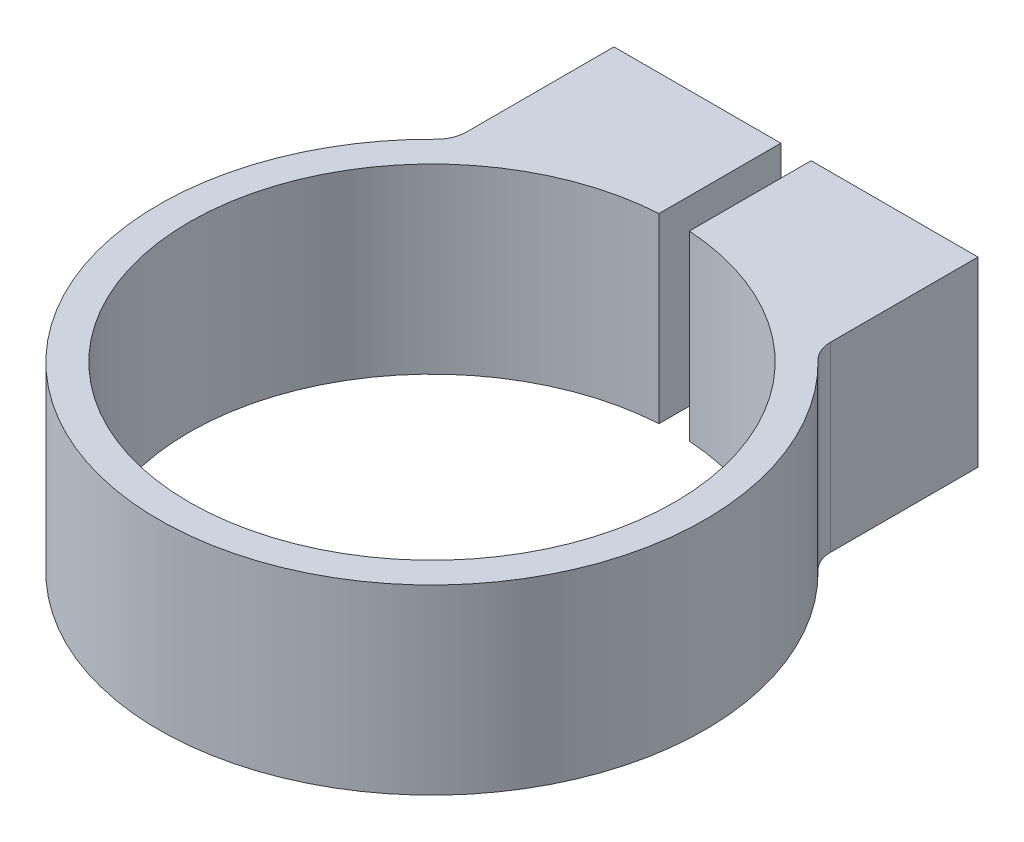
ISO-10303-21;
HEADER;
FILE_DESCRIPTION(('STEP AP214'),'2;1');
FILE_NAME('part.step','',(''),(''),'','','');
FILE_SCHEMA(('AUTOMOTIVE_DESIGN { 1 0 10303 214 1 1 1 1 }'));
ENDSEC;
DATA;
#1=APPLICATION_CONTEXT('core data for automotive mechanical design processes');
#2=APPLICATION_PROTOCOL_DEFINITION('international standard','automotive_design',2000,#1);
#3=PRODUCT_CONTEXT('',#1,'mechanical');
#4=PRODUCT('Part','Part','',(#3));
#5=PRODUCT_RELATED_PRODUCT_CATEGORY('part','',(#4));
#6=PRODUCT_DEFINITION_FORMATION('','',#4);
#7=PRODUCT_DEFINITION_CONTEXT('part definition',#1,'design');
#8=PRODUCT_DEFINITION('design','',#6,#7);
#9=PRODUCT_DEFINITION_SHAPE('','',#8);
#10=(LENGTH_UNIT() NAMED_UNIT(*) SI_UNIT(.MILLI.,.METRE.));
#11=(NAMED_UNIT(*) PLANE_ANGLE_UNIT() SI_UNIT($,.RADIAN.));
#12=(NAMED_UNIT(*) SI_UNIT($,.STERADIAN.) SOLID_ANGLE_UNIT());
#13=UNCERTAINTY_MEASURE_WITH_UNIT(LENGTH_MEASURE(1.E-05),#10,'distance_accuracy_value','');
#14=(GEOMETRIC_REPRESENTATION_CONTEXT(3) GLOBAL_UNCERTAINTY_ASSIGNED_CONTEXT((#13)) GLOBAL_UNIT_ASSIGNED_CONTEXT((#10,
#11,#12)) REPRESENTATION_CONTEXT('',''));
#15=CARTESIAN_POINT('',(0.,0.,0.));
#16=DIRECTION('',(0.,0.,1.));
#17=DIRECTION('',(1.,0.,0.));
#18=AXIS2_PLACEMENT_3D('',#15,#16,#17);
#19=CARTESIAN_POINT('',(-38.1,-38.1,-76.2));
#20=DIRECTION('',(0.,0.,-1.));
#21=DIRECTION('',(-1.,0.,0.));
#22=AXIS2_PLACEMENT_3D('',#19,#20,#21);
#23=PLANE('',#22);
#24=DIRECTION('',(0.,1.,0.));
#25=VECTOR('',#24,1.);
#26=CARTESIAN_POINT('',(-3.175,-38.1,-76.2));
#27=LINE('',#26,#25);
#28=CARTESIAN_POINT('',(-3.175,-38.1,-76.2));
#29=VERTEX_POINT('',#28);
#30=CARTESIAN_POINT('',(-3.175,0.,-76.2));
#31=VERTEX_POINT('',#30);
#32=EDGE_CURVE('E108',#29,#31,#27,.T.);
#33=ORIENTED_EDGE('',*,*,#32,.F.);
#34=DIRECTION('',(-1.,0.,0.));
#35=VECTOR('',#34,1.);
#36=CARTESIAN_POINT('',(-38.1,-38.1,-76.2));
#37=LINE('',#36,#35);
#38=CARTESIAN_POINT('',(-38.1,-38.1,-76.2));
#39=VERTEX_POINT('',#38);
#40=EDGE_CURVE('E147',#29,#39,#37,.T.);
#41=ORIENTED_EDGE('',*,*,#40,.T.);
#42=DIRECTION('',(0.,1.,0.));
#43=VECTOR('',#42,1.);
#44=CARTESIAN_POINT('',(-38.1,-38.1,-76.2));
#45=LINE('',#44,#43);
#46=CARTESIAN_POINT('',(-38.1,0.,-76.2));
#47=VERTEX_POINT('',#46);
#48=EDGE_CURVE('E129',#39,#47,#45,.T.);
#49=ORIENTED_EDGE('',*,*,#48,.T.);
#50=DIRECTION('',(-1.,0.,0.));
#51=VECTOR('',#50,1.);
#52=CARTESIAN_POINT('',(-38.1,0.,-76.2));
#53=LINE('',#52,#51);
#54=EDGE_CURVE('E122',#31,#47,#53,.T.);
#55=ORIENTED_EDGE('',*,*,#54,.F.);
#56=EDGE_LOOP('',(#33,#41,#49,#55));
#57=FACE_BOUND('',#56,.T.);
#58=ADVANCED_FACE('F34',(#57),#23,.T.);
#59=CARTESIAN_POINT('',(-38.1,-38.1,-76.2));
#60=DIRECTION('',(-1.,0.,0.));
#61=DIRECTION('',(0.,0.,1.));
#62=AXIS2_PLACEMENT_3D('',#59,#60,#61);
#63=PLANE('',#62);
#64=DIRECTION('',(0.,0.,1.));
#65=VECTOR('',#64,1.);
#66=CARTESIAN_POINT('',(-38.1,-38.1,-76.2));
#67=LINE('',#66,#65);
#68=CARTESIAN_POINT('',(-38.1,-38.1,-45.3480705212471));
#69=VERTEX_POINT('',#68);
#70=EDGE_CURVE('E135',#39,#69,#67,.T.);
#71=ORIENTED_EDGE('',*,*,#70,.T.);
#72=DIRECTION('',(0.,-1.,0.));
#73=VECTOR('',#72,1.);
#74=CARTESIAN_POINT('',(-38.1,0.,-45.3480705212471));
#75=LINE('',#74,#73);
#76=CARTESIAN_POINT('',(-38.1,0.,-45.3480705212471));
#77=VERTEX_POINT('',#76);
#78=EDGE_CURVE('E153',#69,#77,#75,.F.);
#79=ORIENTED_EDGE('',*,*,#78,.T.);
#80=DIRECTION('',(0.,0.,1.));
#81=VECTOR('',#80,1.);
#82=CARTESIAN_POINT('',(-38.1,0.,-76.2));
#83=LINE('',#82,#81);
#84=EDGE_CURVE('E180',#47,#77,#83,.T.);
#85=ORIENTED_EDGE('',*,*,#84,.F.);
#86=ORIENTED_EDGE('',*,*,#48,.F.);
#87=EDGE_LOOP('',(#71,#79,#85,#86));
#88=FACE_BOUND('',#87,.T.);
#89=ADVANCED_FACE('F36',(#88),#63,.T.);
#90=DIRECTION('',(0.,-1.,0.));
#91=VECTOR('',#90,1.);
#92=CARTESIAN_POINT('',(3.175,-38.1,-76.2));
#93=LINE('',#92,#91);
#94=CARTESIAN_POINT('',(3.175,0.,-76.2));
#95=VERTEX_POINT('',#94);
#96=CARTESIAN_POINT('',(3.175,-38.1,-76.2));
#97=VERTEX_POINT('',#96);
#98=EDGE_CURVE('E116',#95,#97,#93,.T.);
#99=ORIENTED_EDGE('',*,*,#98,.F.);
#100=CARTESIAN_POINT('',(38.1,0.,-76.2));
#101=VERTEX_POINT('',#100);
#102=EDGE_CURVE('E131',#101,#95,#53,.T.);
#103=ORIENTED_EDGE('',*,*,#102,.F.);
#104=DIRECTION('',(0.,1.,0.));
#105=VECTOR('',#104,1.);
#106=CARTESIAN_POINT('',(38.1,-38.1,-76.2));
#107=LINE('',#106,#105);
#108=CARTESIAN_POINT('',(38.1,-38.1,-76.2));
#109=VERTEX_POINT('',#108);
#110=EDGE_CURVE('E151',#109,#101,#107,.T.);
#111=ORIENTED_EDGE('',*,*,#110,.F.);
#112=EDGE_CURVE('E148',#109,#97,#37,.T.);
#113=ORIENTED_EDGE('',*,*,#112,.T.);
#114=EDGE_LOOP('',(#99,#103,#111,#113));
#115=FACE_BOUND('',#114,.T.);
#116=ADVANCED_FACE('F199',(#115),#23,.T.);
#117=CARTESIAN_POINT('',(38.1,-38.1,-76.2));
#118=DIRECTION('',(1.,0.,0.));
#119=DIRECTION('',(0.,0.,-1.));
#120=AXIS2_PLACEMENT_3D('',#117,#118,#119);
#121=PLANE('',#120);
#122=DIRECTION('',(0.,0.,-1.));
#123=VECTOR('',#122,1.);
#124=CARTESIAN_POINT('',(38.1,0.,-76.2));
#125=LINE('',#124,#123);
#126=CARTESIAN_POINT('',(38.1,0.,-45.3480705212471));
#127=VERTEX_POINT('',#126);
#128=EDGE_CURVE('E132',#127,#101,#125,.T.);
#129=ORIENTED_EDGE('',*,*,#128,.F.);
#130=DIRECTION('',(0.,-1.,0.));
#131=VECTOR('',#130,1.);
#132=CARTESIAN_POINT('',(38.1,-38.1,-45.3480705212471));
#133=LINE('',#132,#131);
#134=CARTESIAN_POINT('',(38.1,-38.1,-45.3480705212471));
#135=VERTEX_POINT('',#134);
#136=EDGE_CURVE('E163',#127,#135,#133,.T.);
#137=ORIENTED_EDGE('',*,*,#136,.T.);
#138=DIRECTION('',(0.,0.,-1.));
#139=VECTOR('',#138,1.);
#140=CARTESIAN_POINT('',(38.1,-38.1,-76.2));
#141=LINE('',#140,#139);
#142=EDGE_CURVE('E145',#135,#109,#141,.T.);
#143=ORIENTED_EDGE('',*,*,#142,.T.);
#144=ORIENTED_EDGE('',*,*,#110,.T.);
#145=EDGE_LOOP('',(#129,#137,#143,#144));
#146=FACE_BOUND('',#145,.T.);
#147=ADVANCED_FACE('F204',(#146),#121,.T.);
#148=CARTESIAN_POINT('',(0.,-38.1,0.));
#149=DIRECTION('',(0.,1.,0.));
#150=DIRECTION('',(0.,0.,1.));
#151=AXIS2_PLACEMENT_3D('',#148,#149,#150);
#152=CYLINDRICAL_SURFACE('',#151,57.15);
#153=CARTESIAN_POINT('',(0.,0.,0.));
#154=DIRECTION('',(0.,1.,0.));
#155=DIRECTION('',(0.,0.,1.));
#156=AXIS2_PLACEMENT_3D('',#153,#154,#155);
#157=CIRCLE('',#156,57.15);
#158=CARTESIAN_POINT('',(-40.005,0.,-40.8132634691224));
#159=VERTEX_POINT('',#158);
#160=CARTESIAN_POINT('',(40.005,0.,-40.8132634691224));
#161=VERTEX_POINT('',#160);
#162=EDGE_CURVE('E136',#159,#161,#157,.T.);
#163=ORIENTED_EDGE('',*,*,#162,.F.);
#164=DIRECTION('',(0.,1.,0.));
#165=VECTOR('',#164,1.);
#166=CARTESIAN_POINT('',(-40.005,-38.1,-40.8132634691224));
#167=LINE('',#166,#165);
#168=CARTESIAN_POINT('',(-40.005,-38.1,-40.8132634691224));
#169=VERTEX_POINT('',#168);
#170=EDGE_CURVE('E161',#159,#169,#167,.F.);
#171=ORIENTED_EDGE('',*,*,#170,.T.);
#172=CARTESIAN_POINT('',(0.,-38.1,0.));
#173=DIRECTION('',(0.,1.,0.));
#174=DIRECTION('',(0.,0.,1.));
#175=AXIS2_PLACEMENT_3D('',#172,#173,#174);
#176=CIRCLE('',#175,57.15);
#177=CARTESIAN_POINT('',(40.005,-38.1,-40.8132634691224));
#178=VERTEX_POINT('',#177);
#179=EDGE_CURVE('E142',#169,#178,#176,.T.);
#180=ORIENTED_EDGE('',*,*,#179,.T.);
#181=DIRECTION('',(0.,1.,0.));
#182=VECTOR('',#181,1.);
#183=CARTESIAN_POINT('',(40.005,-38.1,-40.8132634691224));
#184=LINE('',#183,#182);
#185=EDGE_CURVE('E158',#178,#161,#184,.T.);
#186=ORIENTED_EDGE('',*,*,#185,.T.);
#187=EDGE_LOOP('',(#163,#171,#180,#186));
#188=FACE_BOUND('',#187,.T.);
#189=ADVANCED_FACE('F189',(#188),#152,.T.);
#190=CARTESIAN_POINT('',(0.,-38.1,0.));
#191=DIRECTION('',(0.,1.,0.));
#192=DIRECTION('',(0.,0.,1.));
#193=AXIS2_PLACEMENT_3D('',#190,#191,#192);
#194=PLANE('',#193);
#195=ORIENTED_EDGE('',*,*,#40,.F.);
#196=DIRECTION('',(0.,0.,1.));
#197=VECTOR('',#196,1.);
#198=CARTESIAN_POINT('',(-3.175,-38.1,-82.6863871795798));
#199=LINE('',#198,#197);
#200=CARTESIAN_POINT('',(-3.175,-38.1,-50.7006841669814));
#201=VERTEX_POINT('',#200);
#202=EDGE_CURVE('E111',#29,#201,#199,.T.);
#203=ORIENTED_EDGE('',*,*,#202,.T.);
#204=CARTESIAN_POINT('',(0.,-38.1,0.));
#205=DIRECTION('',(0.,1.,0.));
#206=DIRECTION('',(0.,0.,1.));
#207=AXIS2_PLACEMENT_3D('',#204,#205,#206);
#208=CIRCLE('',#207,50.8);
#209=CARTESIAN_POINT('',(3.175,-38.1,-50.7006841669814));
#210=VERTEX_POINT('',#209);
#211=EDGE_CURVE('E176',#201,#210,#208,.T.);
#212=ORIENTED_EDGE('',*,*,#211,.T.);
#213=DIRECTION('',(0.,0.,-1.));
#214=VECTOR('',#213,1.);
#215=CARTESIAN_POINT('',(3.175,-38.1,-82.6863871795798));
#216=LINE('',#215,#214);
#217=EDGE_CURVE('E56',#210,#97,#216,.T.);
#218=ORIENTED_EDGE('',*,*,#217,.T.);
#219=ORIENTED_EDGE('',*,*,#112,.F.);
#220=ORIENTED_EDGE('',*,*,#142,.F.);
#221=CARTESIAN_POINT('',(44.45,-38.1,-45.3480705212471));
#222=DIRECTION('',(0.,1.,0.));
#223=DIRECTION('',(0.,0.,1.));
#224=AXIS2_PLACEMENT_3D('',#221,#222,#223);
#225=CIRCLE('',#224,6.35);
#226=EDGE_CURVE('E171',#135,#178,#225,.T.);
#227=ORIENTED_EDGE('',*,*,#226,.T.);
#228=ORIENTED_EDGE('',*,*,#179,.F.);
#229=CARTESIAN_POINT('',(-44.45,-38.1,-45.3480705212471));
#230=DIRECTION('',(0.,1.,0.));
#231=DIRECTION('',(0.,0.,1.));
#232=AXIS2_PLACEMENT_3D('',#229,#230,#231);
#233=CIRCLE('',#232,6.35);
#234=EDGE_CURVE('E167',#169,#69,#233,.T.);
#235=ORIENTED_EDGE('',*,*,#234,.T.);
#236=ORIENTED_EDGE('',*,*,#70,.F.);
#237=EDGE_LOOP('',(#195,#203,#212,#218,#219,#220,#227,#228,#235,#236));
#238=FACE_BOUND('',#237,.T.);
#239=ADVANCED_FACE('F178',(#238),#194,.F.);
#240=CARTESIAN_POINT('',(0.,0.,0.));
#241=DIRECTION('',(0.,1.,0.));
#242=DIRECTION('',(0.,0.,1.));
#243=AXIS2_PLACEMENT_3D('',#240,#241,#242);
#244=PLANE('',#243);
#245=DIRECTION('',(0.,0.,1.));
#246=VECTOR('',#245,1.);
#247=CARTESIAN_POINT('',(-3.175,0.,-82.6863871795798));
#248=LINE('',#247,#246);
#249=CARTESIAN_POINT('',(-3.175,0.,-50.7006841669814));
#250=VERTEX_POINT('',#249);
#251=EDGE_CURVE('E49',#31,#250,#248,.T.);
#252=ORIENTED_EDGE('',*,*,#251,.F.);
#253=ORIENTED_EDGE('',*,*,#54,.T.);
#254=ORIENTED_EDGE('',*,*,#84,.T.);
#255=CARTESIAN_POINT('',(-44.45,0.,-45.3480705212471));
#256=DIRECTION('',(0.,1.,0.));
#257=DIRECTION('',(0.,0.,1.));
#258=AXIS2_PLACEMENT_3D('',#255,#256,#257);
#259=CIRCLE('',#258,6.35);
#260=EDGE_CURVE('E165',#77,#159,#259,.F.);
#261=ORIENTED_EDGE('',*,*,#260,.T.);
#262=ORIENTED_EDGE('',*,*,#162,.T.);
#263=CARTESIAN_POINT('',(44.45,0.,-45.3480705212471));
#264=DIRECTION('',(0.,1.,0.));
#265=DIRECTION('',(0.,0.,1.));
#266=AXIS2_PLACEMENT_3D('',#263,#264,#265);
#267=CIRCLE('',#266,6.35);
#268=EDGE_CURVE('E169',#161,#127,#267,.F.);
#269=ORIENTED_EDGE('',*,*,#268,.T.);
#270=ORIENTED_EDGE('',*,*,#128,.T.);
#271=ORIENTED_EDGE('',*,*,#102,.T.);
#272=DIRECTION('',(0.,0.,-1.));
#273=VECTOR('',#272,1.);
#274=CARTESIAN_POINT('',(3.175,0.,-82.6863871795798));
#275=LINE('',#274,#273);
#276=CARTESIAN_POINT('',(3.175,0.,-50.7006841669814));
#277=VERTEX_POINT('',#276);
#278=EDGE_CURVE('E126',#277,#95,#275,.T.);
#279=ORIENTED_EDGE('',*,*,#278,.F.);
#280=CARTESIAN_POINT('',(0.,0.,0.));
#281=DIRECTION('',(0.,1.,0.));
#282=DIRECTION('',(0.,0.,1.));
#283=AXIS2_PLACEMENT_3D('',#280,#281,#282);
#284=CIRCLE('',#283,50.8);
#285=EDGE_CURVE('E115',#250,#277,#284,.T.);
#286=ORIENTED_EDGE('',*,*,#285,.F.);
#287=EDGE_LOOP('',(#252,#253,#254,#261,#262,#269,#270,#271,#279,#286));
#288=FACE_BOUND('',#287,.T.);
#289=ADVANCED_FACE('F120',(#288),#244,.T.);
#290=CARTESIAN_POINT('',(0.,-38.1,0.));
#291=DIRECTION('',(0.,1.,0.));
#292=DIRECTION('',(0.,0.,1.));
#293=AXIS2_PLACEMENT_3D('',#290,#291,#292);
#294=CYLINDRICAL_SURFACE('',#293,50.8);
#295=ORIENTED_EDGE('',*,*,#211,.F.);
#296=DIRECTION('',(0.,1.,0.));
#297=VECTOR('',#296,1.);
#298=CARTESIAN_POINT('',(-3.175,-38.1,-50.7006841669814));
#299=LINE('',#298,#297);
#300=EDGE_CURVE('E11',#201,#250,#299,.T.);
#301=ORIENTED_EDGE('',*,*,#300,.T.);
#302=ORIENTED_EDGE('',*,*,#285,.T.);
#303=DIRECTION('',(0.,1.,0.));
#304=VECTOR('',#303,1.);
#305=CARTESIAN_POINT('',(3.175,-38.1,-50.7006841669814));
#306=LINE('',#305,#304);
#307=EDGE_CURVE('E42',#277,#210,#306,.F.);
#308=ORIENTED_EDGE('',*,*,#307,.T.);
#309=EDGE_LOOP('',(#295,#301,#302,#308));
#310=FACE_BOUND('',#309,.T.);
#311=ADVANCED_FACE('F175',(#310),#294,.F.);
#312=CARTESIAN_POINT('',(-44.45,-38.1,-45.3480705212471));
#313=DIRECTION('',(0.,1.,0.));
#314=DIRECTION('',(0.,0.,1.));
#315=AXIS2_PLACEMENT_3D('',#312,#313,#314);
#316=CYLINDRICAL_SURFACE('',#315,6.35);
#317=ORIENTED_EDGE('',*,*,#234,.F.);
#318=ORIENTED_EDGE('',*,*,#170,.F.);
#319=ORIENTED_EDGE('',*,*,#260,.F.);
#320=ORIENTED_EDGE('',*,*,#78,.F.);
#321=EDGE_LOOP('',(#317,#318,#319,#320));
#322=FACE_BOUND('',#321,.T.);
#323=ADVANCED_FACE('F194',(#322),#316,.F.);
#324=CARTESIAN_POINT('',(44.45,-38.1,-45.3480705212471));
#325=DIRECTION('',(0.,1.,0.));
#326=DIRECTION('',(0.,0.,1.));
#327=AXIS2_PLACEMENT_3D('',#324,#325,#326);
#328=CYLINDRICAL_SURFACE('',#327,6.35);
#329=ORIENTED_EDGE('',*,*,#226,.F.);
#330=ORIENTED_EDGE('',*,*,#136,.F.);
#331=ORIENTED_EDGE('',*,*,#268,.F.);
#332=ORIENTED_EDGE('',*,*,#185,.F.);
#333=EDGE_LOOP('',(#329,#330,#331,#332));
#334=FACE_BOUND('',#333,.T.);
#335=ADVANCED_FACE('F228',(#334),#328,.F.);
#336=CARTESIAN_POINT('',(3.175,-38.1,-82.6863871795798));
#337=DIRECTION('',(1.,0.,0.));
#338=DIRECTION('',(0.,0.,-1.));
#339=AXIS2_PLACEMENT_3D('',#336,#337,#338);
#340=PLANE('',#339);
#341=ORIENTED_EDGE('',*,*,#98,.T.);
#342=ORIENTED_EDGE('',*,*,#217,.F.);
#343=ORIENTED_EDGE('',*,*,#307,.F.);
#344=ORIENTED_EDGE('',*,*,#278,.T.);
#345=EDGE_LOOP('',(#341,#342,#343,#344));
#346=FACE_BOUND('',#345,.T.);
#347=ADVANCED_FACE('F231',(#346),#340,.F.);
#348=CARTESIAN_POINT('',(-3.175,-38.1,-82.6863871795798));
#349=DIRECTION('',(-1.,0.,0.));
#350=DIRECTION('',(0.,0.,1.));
#351=AXIS2_PLACEMENT_3D('',#348,#349,#350);
#352=PLANE('',#351);
#353=ORIENTED_EDGE('',*,*,#32,.T.);
#354=ORIENTED_EDGE('',*,*,#251,.T.);
#355=ORIENTED_EDGE('',*,*,#300,.F.);
#356=ORIENTED_EDGE('',*,*,#202,.F.);
#357=EDGE_LOOP('',(#353,#354,#355,#356));
#358=FACE_BOUND('',#357,.T.);
#359=ADVANCED_FACE('F109',(#358),#352,.F.);
#360=CLOSED_SHELL('',(#58,#89,#116,#147,#189,#239,#289,#311,#323,#335,#347,#359));
#361=MANIFOLD_SOLID_BREP('B2',#360);
#362=ADVANCED_BREP_SHAPE_REPRESENTATION('',(#18,#361),#14);
#363=SHAPE_DEFINITION_REPRESENTATION(#9,#362);
ENDSEC;
END-ISO-10303-21;
